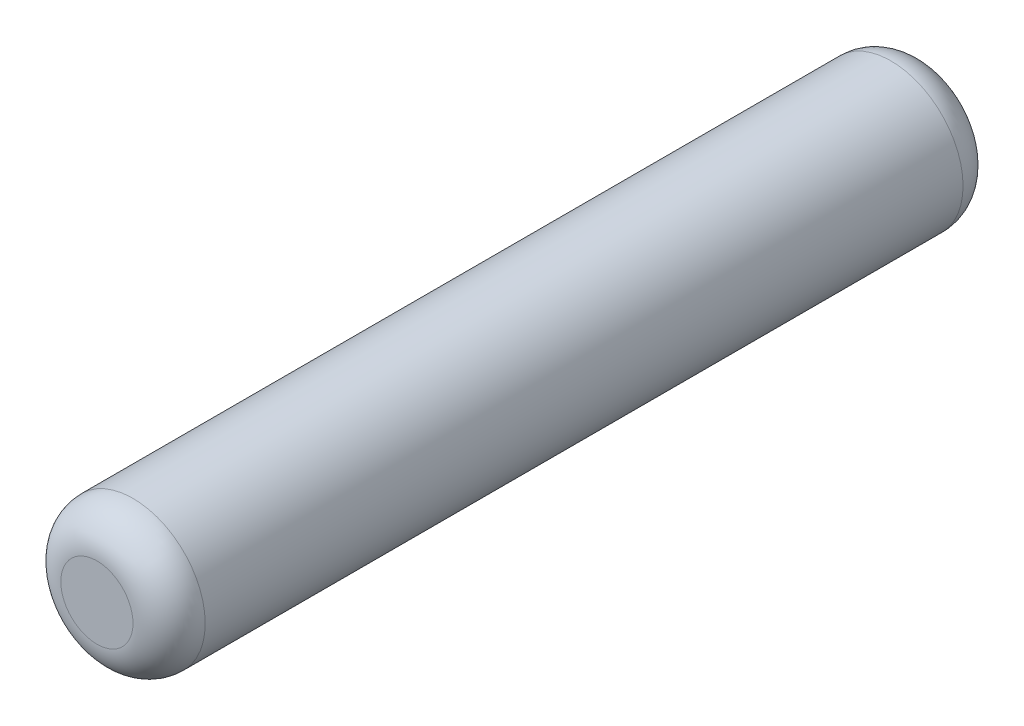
from build123d import *

# Parameters (mm, degrees)
ESQUISSE1_R          = 1
BASE_EXTRUSION_DEPTH = 5.75
CONG_1_R             = 0.5


with BuildPart() as part:
    # Esquisse1 → Base-Extrusion (new, symmetric)
    with BuildSketch(Plane.XY):
        Circle(ESQUISSE1_R)
    extrude(amount=BASE_EXTRUSION_DEPTH, both=True)

    # Cong_1
    cong_1_edges = [part.edges().sort_by_distance(p)[0] for p in [
        (-1, 0, -5.75),
        (-1, 0, 5.75),
    ]]
    fillet(cong_1_edges, radius=CONG_1_R)


solid = part.part
